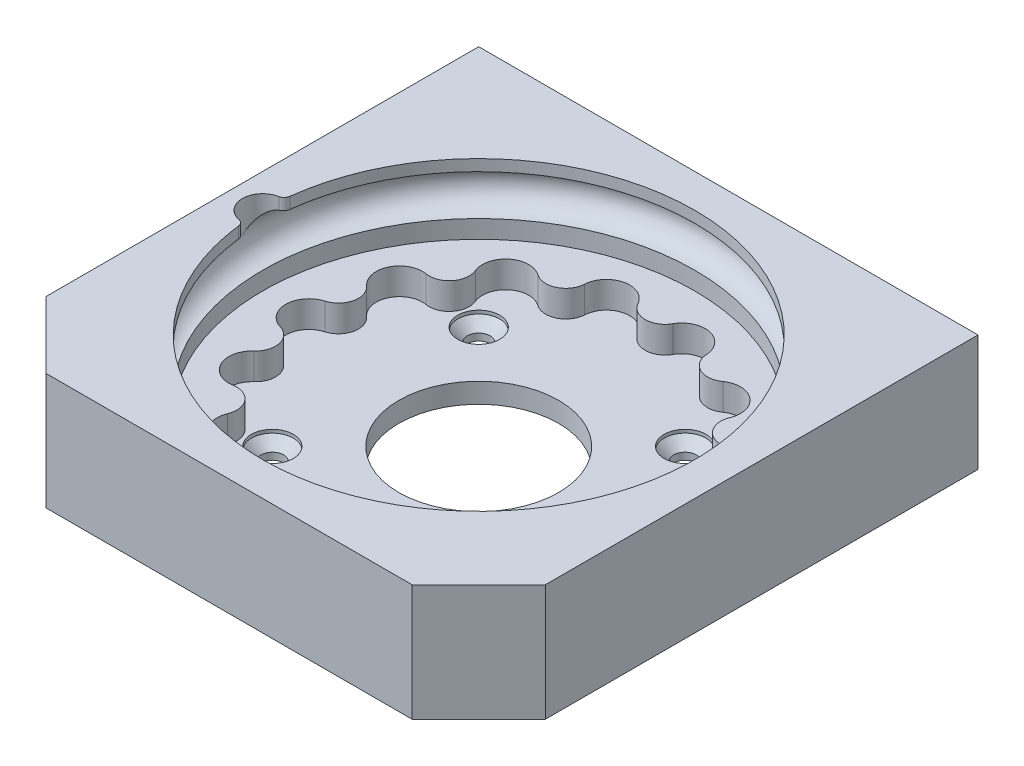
from build123d import *

# Parameters (mm, degrees)
SKETCH3_W                                    = 75
SKETCH3_H                                    = 75
SKETCH3_R                                    = 4.1
BOSS_EXTRUDE1_DEPTH                          = 3
SKETCH4_W                                    = 75
SKETCH4_H                                    = 75
SKETCH4_R                                    = 3
BOSS_EXTRUDE2_DEPTH                          = 4
SKETCH5_W                                    = 75
SKETCH5_H                                    = 75
SKETCH5_R                                    = 32.45
BOSS_EXTRUDE3_DEPTH                          = 10.5
CHAMFER1_SIZE                                = 10
SKETCH11_R                                   = 3.05
CUT_EXTRUDE2_REACH                           = 57.846
CUT_EXTRUDE2_END_MAJOR_RADIUS                = 32.45
CUT_EXTRUDE2_END_MINOR_RADIUS                = 3.05
SKETCH12_R                                   = 3.05
FILLET2_R                                    = 1
SKETCH14_R                                   = 12
CUT_EXTRUDE3_DEPTH                           = 56.845769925
CSK_FOR_M3_COUNTERSUNK_FLAT_HEAD_SCR_2_COUNT = 2
CSK_FOR_M3_COUNTERSUNK_FLAT_HEAD_SCR_2_PITCH = 31
CSK_FOR_M3_COUNTERSUNK_FLAT_HEAD_SCR_3_COUNT = 2
CSK_FOR_M3_COUNTERSUNK_FLAT_HEAD_SCR_3_PITCH = 43.840620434
CSK_FOR_M3_COUNTERSUNK_FLAT_HEAD_SCR_4_COUNT = 2
CSK_FOR_M3_COUNTERSUNK_FLAT_HEAD_SCR_4_PITCH = 31


with BuildPart() as part:
    # Sketch3 → Boss-Extrude1 (new body)
    with BuildSketch(Plane(origin=(0, 0, 0), x_dir=(1, 0, 0), z_dir=(0, 1, 0))):
        Rectangle(SKETCH3_W, SKETCH3_H)
        with Locations(Location((0, 0, 0), (0, 0, 270))):
            Circle(SKETCH3_R, mode=Mode.SUBTRACT)
    extrude(amount=BOSS_EXTRUDE1_DEPTH)

    # Sketch4 → Boss-Extrude2 (add)
    # profile 1 of 15: a face of its own
    with BuildSketch(Plane(origin=(0, 3, 0), x_dir=(1, 0, 0), z_dir=(0, 1, 0))):
        Rectangle(SKETCH4_W, SKETCH4_H)
        with BuildLine():
            ThreePointArc((26.466201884, -3.34820127), (29.101403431, -3.833156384), (30.297981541, -6.230586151))
            ThreePointArc((30.297981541, -6.230586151), (28.522709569, -8.969206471), (25.297954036, -8.466629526))
            ThreePointArc((25.297954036, -8.466629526), (26.114424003, -12.576043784), (22.392493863, -14.499879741))
            ThreePointArc((22.392493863, -14.499879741), (24.182966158, -15.521692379), (24.891281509, -17.457714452))
            ThreePointArc((24.891281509, -17.457714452), (22.475902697, -20.400199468), (19.119136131, -18.604540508))
            ThreePointArc((19.119136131, -18.604540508), (18.071742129, -22.661247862), (13.883677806, -22.779679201))
            ThreePointArc((13.883677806, -22.779679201), (14.813777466, -23.849594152), (15.148744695, -25.227128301))
            ThreePointArc((15.148744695, -25.227128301), (12.063943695, -28.225929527), (9.153538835, -25.057594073))
            ThreePointArc((9.153538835, -25.057594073), (6.449730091, -28.258113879), (2.625029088, -26.54768382))
            ThreePointArc((2.625029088, -26.54768382), (2.90474502, -27.250029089), (3, -28))
            ThreePointArc((3, -28), (-0.749970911, -30.90474502), (-2.625029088, -26.54768382))
            ThreePointArc((-2.625029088, -26.54768382), (-6.449730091, -28.258113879), (-9.153538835, -25.057594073))
            ThreePointArc((-9.153538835, -25.057594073), (-9.14994347, -25.142327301), (-9.148744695, -25.227128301))
            ThreePointArc((-9.148744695, -25.227128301), (-13.526278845, -27.892161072), (-13.883677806, -22.779679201))
            ThreePointArc((-13.883677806, -22.779679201), (-18.071742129, -22.661247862), (-19.119136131, -18.604540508))
            ThreePointArc((-19.119136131, -18.604540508), (-24.236775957, -19.328183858), (-22.392493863, -14.499879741))
            ThreePointArc((-22.392493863, -14.499879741), (-26.114424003, -12.576043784), (-25.297954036, -8.466629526))
            ThreePointArc((-25.297954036, -8.466629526), (-30.222765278, -6.898148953), (-26.466201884, -3.34820127))
            ThreePointArc((-26.466201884, -3.34820127), (-28.98482393, 0), (-26.466201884, 3.34820127))
            ThreePointArc((-26.466201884, 3.34820127), (-30.222765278, 6.898148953), (-25.297954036, 8.466629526))
            ThreePointArc((-25.297954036, 8.466629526), (-26.114424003, 12.576043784), (-22.392493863, 14.499879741))
            ThreePointArc((-22.392493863, 14.499879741), (-24.236775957, 19.328183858), (-19.119136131, 18.604540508))
            ThreePointArc((-19.119136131, 18.604540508), (-18.071742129, 22.661247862), (-13.883677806, 22.779679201))
            ThreePointArc((-13.883677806, 22.779679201), (-13.526278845, 27.892161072), (-9.148744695, 25.227128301))
            ThreePointArc((-9.148744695, 25.227128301), (-9.14994347, 25.142327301), (-9.153538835, 25.057594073))
            ThreePointArc((-9.153538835, 25.057594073), (-6.449730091, 28.258113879), (-2.625029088, 26.54768382))
            ThreePointArc((-2.625029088, 26.54768382), (-0.749970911, 30.90474502), (3, 28))
            ThreePointArc((3, 28), (2.90474502, 27.250029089), (2.625029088, 26.54768382))
            ThreePointArc((2.625029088, 26.54768382), (6.449730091, 28.258113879), (9.153538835, 25.057594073))
            ThreePointArc((9.153538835, 25.057594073), (12.063943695, 28.225929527), (15.148744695, 25.227128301))
            ThreePointArc((15.148744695, 25.227128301), (14.813777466, 23.849594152), (13.883677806, 22.779679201))
            ThreePointArc((13.883677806, 22.779679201), (18.071742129, 22.661247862), (19.119136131, 18.604540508))
            ThreePointArc((19.119136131, 18.604540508), (22.475902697, 20.400199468), (24.891281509, 17.457714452))
            ThreePointArc((24.891281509, 17.457714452), (24.182966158, 15.521692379), (22.392493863, 14.499879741))
            ThreePointArc((22.392493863, 14.499879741), (26.114424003, 12.576043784), (25.297954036, 8.466629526))
            ThreePointArc((25.297954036, 8.466629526), (28.522709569, 8.969206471), (30.297981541, 6.230586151))
            ThreePointArc((30.297981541, 6.230586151), (29.101403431, 3.833156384), (26.466201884, 3.34820127))
            ThreePointArc((26.466201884, 3.34820127), (28.98482393, 0), (26.466201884, -3.34820127))
        make_face(mode=Mode.SUBTRACT)
    # profile 2 of 15: a face of its own
    with BuildSketch(Plane(origin=(0, 3, 0), x_dir=(1, 0, 0), z_dir=(0, 1, 0))):
        with Locations((21.891281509, 17.457714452)):
            Circle(SKETCH4_R)
    # profile 3 of 15: a face of its own
    with BuildSketch(Plane(origin=(0, 3, 0), x_dir=(1, 0, 0), z_dir=(0, 1, 0))):
        with Locations((27.297981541, 6.230586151)):
            Circle(SKETCH4_R)
    # profile 4 of 15: a face of its own
    with BuildSketch(Plane(origin=(0, 3, 0), x_dir=(1, 0, 0), z_dir=(0, 1, 0))):
        with Locations((27.297981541, -6.230586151)):
            Circle(SKETCH4_R)
    # profile 5 of 15: a face of its own
    with BuildSketch(Plane(origin=(0, 3, 0), x_dir=(1, 0, 0), z_dir=(0, 1, 0))):
        with Locations((21.891281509, -17.457714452)):
            Circle(SKETCH4_R)
    # profile 6 of 15: a face of its own
    with BuildSketch(Plane(origin=(0, 3, 0), x_dir=(1, 0, 0), z_dir=(0, 1, 0))):
        with Locations((12.148744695, -25.227128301)):
            Circle(SKETCH4_R)
    # profile 7 of 15: a face of its own
    with BuildSketch(Plane(origin=(0, 3, 0), x_dir=(1, 0, 0), z_dir=(0, 1, 0))):
        with Locations((0, -28)):
            Circle(SKETCH4_R)
    # profile 8 of 15: a face of its own
    with BuildSketch(Plane(origin=(0, 3, 0), x_dir=(1, 0, 0), z_dir=(0, 1, 0))):
        with Locations((-12.148744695, -25.227128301)):
            Circle(SKETCH4_R)
    # profile 9 of 15: a face of its own
    with BuildSketch(Plane(origin=(0, 3, 0), x_dir=(1, 0, 0), z_dir=(0, 1, 0))):
        with Locations((-21.891281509, -17.457714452)):
            Circle(SKETCH4_R)
    # profile 10 of 15: a face of its own
    with BuildSketch(Plane(origin=(0, 3, 0), x_dir=(1, 0, 0), z_dir=(0, 1, 0))):
        with Locations((-27.297981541, -6.230586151)):
            Circle(SKETCH4_R)
    # profile 11 of 15: a face of its own
    with BuildSketch(Plane(origin=(0, 3, 0), x_dir=(1, 0, 0), z_dir=(0, 1, 0))):
        with Locations((-27.297981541, 6.230586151)):
            Circle(SKETCH4_R)
    # profile 12 of 15: a face of its own
    with BuildSketch(Plane(origin=(0, 3, 0), x_dir=(1, 0, 0), z_dir=(0, 1, 0))):
        with Locations((-21.891281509, 17.457714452)):
            Circle(SKETCH4_R)
    # profile 13 of 15: a face of its own
    with BuildSketch(Plane(origin=(0, 3, 0), x_dir=(1, 0, 0), z_dir=(0, 1, 0))):
        with Locations((-12.148744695, 25.227128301)):
            Circle(SKETCH4_R)
    # profile 14 of 15: a face of its own
    with BuildSketch(Plane(origin=(0, 3, 0), x_dir=(1, 0, 0), z_dir=(0, 1, 0))):
        with Locations((0, 28)):
            Circle(SKETCH4_R)
    # profile 15 of 15: a face of its own
    with BuildSketch(Plane(origin=(0, 3, 0), x_dir=(1, 0, 0), z_dir=(0, 1, 0))):
        with Locations((12.148744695, 25.227128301)):
            Circle(SKETCH4_R)
    extrude(amount=BOSS_EXTRUDE2_DEPTH)

    # Sketch5 → Boss-Extrude3 (add)
    with BuildSketch(Plane(origin=(0, 7, 0), x_dir=(1, 0, 0), z_dir=(0, 1, 0))):
        Rectangle(SKETCH5_W, SKETCH5_H)
        with Locations(Location((0, 0, 0), (0, 0, 90))):
            Circle(SKETCH5_R, mode=Mode.SUBTRACT)
    extrude(amount=BOSS_EXTRUDE3_DEPTH)

    # Chamfer1
    chamfer1_edges = [part.edges().sort_by_distance(p)[0] for p in [
        (37.5, 8.75, 37.5),
        (-37.5, 8.75, 37.5),
    ]]
    chamfer(chamfer1_edges, length=CHAMFER1_SIZE)

    # Sketch11 → Cut-Revolve1 (revolve, cut)
    with BuildSketch(Plane.XY, mode=Mode.PRIVATE) as cut_revolve1_sk:
        with Locations((-32.45, 12.75)):
            Circle(SKETCH11_R)
    revolve(cut_revolve1_sk.sketch.rotate(Axis((0, 0, 0), (0, 1, 0)), 270), axis=Axis((0, 0, 0), (0, 1, 0)), mode=Mode.SUBTRACT)

    # Cut-Extrude2: up to this torus (the profile starts outside it)
    cut_extrude2_end = Plane(origin=(0, 12.75, 0), z_dir=(0, -1, 0)) * Torus(CUT_EXTRUDE2_END_MAJOR_RADIUS, CUT_EXTRUDE2_END_MINOR_RADIUS, mode=Mode.PRIVATE)
    # Sketch12 → Cut-Extrude2 (cut, up to the surface)
    with BuildSketch(Plane(origin=(0, 17.5, 0), x_dir=(1, 0, 0), z_dir=(0, 1, 0)), mode=Mode.PRIVATE) as cut_extrude2_sk1:
        with Locations((-32.45, 0)):
            Circle(SKETCH12_R)
    cut_extrude2_tool1 = extrude(cut_extrude2_sk1.sketch, amount=-CUT_EXTRUDE2_REACH, mode=Mode.PRIVATE) - cut_extrude2_end
    add(cut_extrude2_tool1.solids().sort_by_distance((-32.45, 17.5, 0))[0], mode=Mode.SUBTRACT)

    # Fillet2
    fillet2_edges = [part.edges().sort_by_distance(p)[0] for p in [
        (-32.306664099, 16.649999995, -3.046630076),
        (-32.306664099, 16.649999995, 3.046630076),
    ]]
    fillet(fillet2_edges, radius=FILLET2_R)

    # Sketch14 → Cut-Extrude3 (cut, through all)
    with BuildSketch(Plane.XZ):
        with Locations(Location((0, 0, 0), (0, 0, 270))):
            Circle(SKETCH14_R)
    extrude(amount=-CUT_EXTRUDE3_DEPTH, mode=Mode.SUBTRACT)

    # Sketch16 → CSK for M3 Countersunk Flat Head Screw1 (revolve, cut)
    with BuildSketch(Plane(origin=(-15.5, 3, -15.5), x_dir=(0, 0, 1), z_dir=(1, 0, 0))):
        Polygon((0, 0), (0, 3), (1.7, 3), (1.7, 1.95), (3.15, 0.5), (3.15, 0), align=None)
    csk_for_m3_countersunk_flat_head_screw1 = revolve(axis=Axis((-15.5, 9.35, -15.5), (0, -1, 0)), mode=Mode.SUBTRACT)

    # CSK for M3 Countersunk Flat Head Scr 2: CSK for M3 Countersunk Flat Head Screw1 ×2
    with Locations(*[(i * CSK_FOR_M3_COUNTERSUNK_FLAT_HEAD_SCR_2_PITCH, 0, 0) for i in range(1, CSK_FOR_M3_COUNTERSUNK_FLAT_HEAD_SCR_2_COUNT)]):
        add(csk_for_m3_countersunk_flat_head_screw1, mode=Mode.SUBTRACT)

    # CSK for M3 Countersunk Flat Head Scr 3: CSK for M3 Countersunk Flat Head Screw1 ×2
    with Locations(*[Vector(0.7071067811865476, 0, 0.7071067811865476) * (i * CSK_FOR_M3_COUNTERSUNK_FLAT_HEAD_SCR_3_PITCH) for i in range(1, CSK_FOR_M3_COUNTERSUNK_FLAT_HEAD_SCR_3_COUNT)]):
        add(csk_for_m3_countersunk_flat_head_screw1, mode=Mode.SUBTRACT)

    # CSK for M3 Countersunk Flat Head Scr 4: CSK for M3 Countersunk Flat Head Screw1 ×2
    with Locations(*[(0, 0, i * CSK_FOR_M3_COUNTERSUNK_FLAT_HEAD_SCR_4_PITCH) for i in range(1, CSK_FOR_M3_COUNTERSUNK_FLAT_HEAD_SCR_4_COUNT)]):
        add(csk_for_m3_countersunk_flat_head_screw1, mode=Mode.SUBTRACT)


solid = part.part
